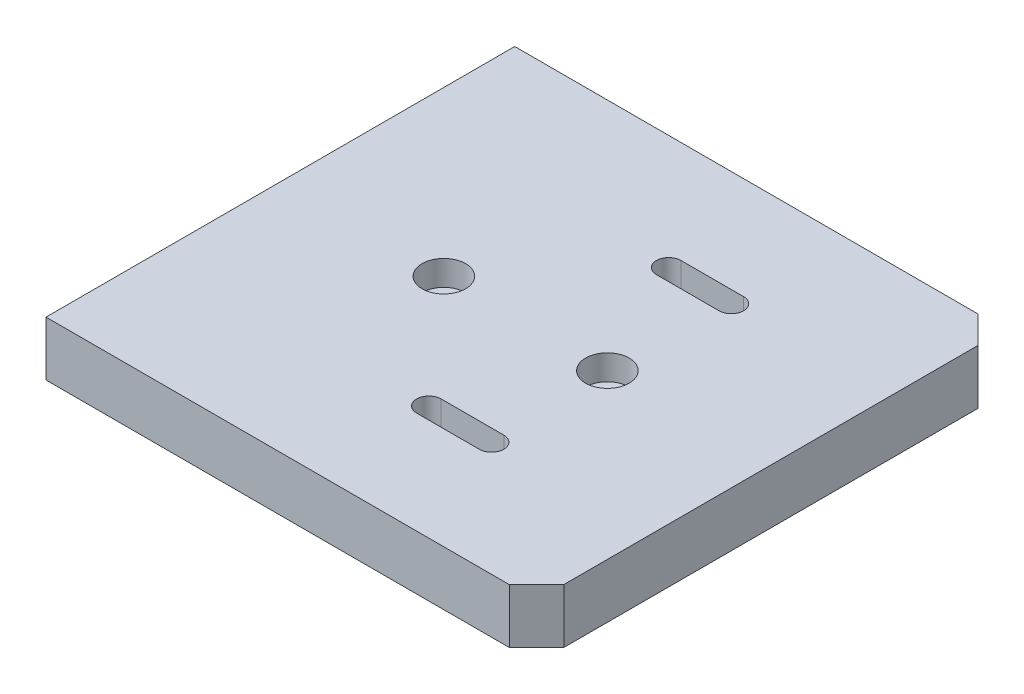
ISO-10303-21;
HEADER;
FILE_DESCRIPTION(('STEP AP214'),'2;1');
FILE_NAME('part.step','',(''),(''),'','','');
FILE_SCHEMA(('AUTOMOTIVE_DESIGN { 1 0 10303 214 1 1 1 1 }'));
ENDSEC;
DATA;
#1=APPLICATION_CONTEXT('core data for automotive mechanical design processes');
#2=APPLICATION_PROTOCOL_DEFINITION('international standard','automotive_design',2000,#1);
#3=PRODUCT_CONTEXT('',#1,'mechanical');
#4=PRODUCT('Part','Part','',(#3));
#5=PRODUCT_RELATED_PRODUCT_CATEGORY('part','',(#4));
#6=PRODUCT_DEFINITION_FORMATION('','',#4);
#7=PRODUCT_DEFINITION_CONTEXT('part definition',#1,'design');
#8=PRODUCT_DEFINITION('design','',#6,#7);
#9=PRODUCT_DEFINITION_SHAPE('','',#8);
#10=(LENGTH_UNIT() NAMED_UNIT(*) SI_UNIT(.MILLI.,.METRE.));
#11=(NAMED_UNIT(*) PLANE_ANGLE_UNIT() SI_UNIT($,.RADIAN.));
#12=(NAMED_UNIT(*) SI_UNIT($,.STERADIAN.) SOLID_ANGLE_UNIT());
#13=UNCERTAINTY_MEASURE_WITH_UNIT(LENGTH_MEASURE(1.E-05),#10,'distance_accuracy_value','');
#14=(GEOMETRIC_REPRESENTATION_CONTEXT(3) GLOBAL_UNCERTAINTY_ASSIGNED_CONTEXT((#13)) GLOBAL_UNIT_ASSIGNED_CONTEXT((#10,
#11,#12)) REPRESENTATION_CONTEXT('',''));
#15=CARTESIAN_POINT('',(0.,0.,0.));
#16=DIRECTION('',(0.,0.,1.));
#17=DIRECTION('',(1.,0.,0.));
#18=AXIS2_PLACEMENT_3D('',#15,#16,#17);
#19=CARTESIAN_POINT('',(0.,31.6094189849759,-86.));
#20=DIRECTION('',(0.,-1.,0.));
#21=DIRECTION('',(0.,0.,-1.));
#22=AXIS2_PLACEMENT_3D('',#19,#20,#21);
#23=PLANE('',#22);
#24=CARTESIAN_POINT('',(60.,31.6094189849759,-43.));
#25=DIRECTION('',(0.,1.,0.));
#26=DIRECTION('',(0.,0.,1.));
#27=AXIS2_PLACEMENT_3D('',#24,#25,#26);
#28=CIRCLE('',#27,2.25);
#29=CARTESIAN_POINT('',(60.,31.6094189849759,-40.75));
#30=VERTEX_POINT('',#29);
#31=EDGE_CURVE('E545',#30,#30,#28,.T.);
#32=ORIENTED_EDGE('',*,*,#31,.T.);
#33=EDGE_LOOP('',(#32));
#34=FACE_BOUND('',#33,.T.);
#35=CARTESIAN_POINT('',(30.,31.6094189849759,-43.));
#36=DIRECTION('',(0.,1.,0.));
#37=DIRECTION('',(0.,0.,1.));
#38=AXIS2_PLACEMENT_3D('',#35,#36,#37);
#39=CIRCLE('',#38,2.25);
#40=CARTESIAN_POINT('',(30.,31.6094189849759,-40.75));
#41=VERTEX_POINT('',#40);
#42=EDGE_CURVE('E193',#41,#41,#39,.T.);
#43=ORIENTED_EDGE('',*,*,#42,.T.);
#44=EDGE_LOOP('',(#43));
#45=FACE_BOUND('',#44,.T.);
#46=CARTESIAN_POINT('',(49.25,31.6094189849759,-21.));
#47=DIRECTION('',(0.,-1.,0.));
#48=DIRECTION('',(0.,0.,-1.));
#49=AXIS2_PLACEMENT_3D('',#46,#47,#48);
#50=CIRCLE('',#49,4.);
#51=CARTESIAN_POINT('',(49.25,31.6094189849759,-17.));
#52=VERTEX_POINT('',#51);
#53=CARTESIAN_POINT('',(49.25,31.6094189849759,-25.));
#54=VERTEX_POINT('',#53);
#55=EDGE_CURVE('E230',#52,#54,#50,.T.);
#56=ORIENTED_EDGE('',*,*,#55,.F.);
#57=DIRECTION('',(1.,0.,0.));
#58=VECTOR('',#57,1.);
#59=CARTESIAN_POINT('',(49.25,31.6094189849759,-17.));
#60=LINE('',#59,#58);
#61=CARTESIAN_POINT('',(60.75,31.6094189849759,-17.));
#62=VERTEX_POINT('',#61);
#63=EDGE_CURVE('E222',#52,#62,#60,.T.);
#64=ORIENTED_EDGE('',*,*,#63,.T.);
#65=CARTESIAN_POINT('',(60.75,31.6094189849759,-21.));
#66=DIRECTION('',(0.,-1.,0.));
#67=DIRECTION('',(0.,0.,-1.));
#68=AXIS2_PLACEMENT_3D('',#65,#66,#67);
#69=CIRCLE('',#68,4.);
#70=CARTESIAN_POINT('',(60.75,31.6094189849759,-25.));
#71=VERTEX_POINT('',#70);
#72=EDGE_CURVE('E252',#71,#62,#69,.T.);
#73=ORIENTED_EDGE('',*,*,#72,.F.);
#74=DIRECTION('',(1.,0.,0.));
#75=VECTOR('',#74,1.);
#76=CARTESIAN_POINT('',(49.25,31.6094189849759,-25.));
#77=LINE('',#76,#75);
#78=EDGE_CURVE('E205',#54,#71,#77,.T.);
#79=ORIENTED_EDGE('',*,*,#78,.F.);
#80=EDGE_LOOP('',(#56,#64,#73,#79));
#81=FACE_BOUND('',#80,.T.);
#82=DIRECTION('',(1.,0.,0.));
#83=VECTOR('',#82,1.);
#84=CARTESIAN_POINT('',(0.,31.6094189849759,-86.));
#85=LINE('',#84,#83);
#86=CARTESIAN_POINT('',(0.,31.6094189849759,-86.));
#87=VERTEX_POINT('',#86);
#88=CARTESIAN_POINT('',(85.,31.6094189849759,-86.));
#89=VERTEX_POINT('',#88);
#90=EDGE_CURVE('E337',#87,#89,#85,.T.);
#91=ORIENTED_EDGE('',*,*,#90,.T.);
#92=DIRECTION('',(0.707106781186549,0.,0.707106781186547));
#93=VECTOR('',#92,1.);
#94=CARTESIAN_POINT('',(42.5,31.6094189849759,-128.5));
#95=LINE('',#94,#93);
#96=CARTESIAN_POINT('',(90.,31.6094189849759,-81.));
#97=VERTEX_POINT('',#96);
#98=EDGE_CURVE('E24',#89,#97,#95,.T.);
#99=ORIENTED_EDGE('',*,*,#98,.T.);
#100=DIRECTION('',(0.,0.,1.));
#101=VECTOR('',#100,1.);
#102=CARTESIAN_POINT('',(90.,31.6094189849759,-86.));
#103=LINE('',#102,#101);
#104=CARTESIAN_POINT('',(90.,31.6094189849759,-5.00000000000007));
#105=VERTEX_POINT('',#104);
#106=EDGE_CURVE('E355',#97,#105,#103,.T.);
#107=ORIENTED_EDGE('',*,*,#106,.T.);
#108=DIRECTION('',(0.707106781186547,0.,-0.707106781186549));
#109=VECTOR('',#108,1.);
#110=CARTESIAN_POINT('',(85.5,31.6094189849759,-0.500000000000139));
#111=LINE('',#110,#109);
#112=CARTESIAN_POINT('',(85.,31.6094189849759,0.));
#113=VERTEX_POINT('',#112);
#114=EDGE_CURVE('E31',#105,#113,#111,.F.);
#115=ORIENTED_EDGE('',*,*,#114,.T.);
#116=DIRECTION('',(1.,0.,0.));
#117=VECTOR('',#116,1.);
#118=CARTESIAN_POINT('',(0.,31.6094189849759,0.));
#119=LINE('',#118,#117);
#120=CARTESIAN_POINT('',(0.,31.6094189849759,0.));
#121=VERTEX_POINT('',#120);
#122=EDGE_CURVE('E345',#121,#113,#119,.T.);
#123=ORIENTED_EDGE('',*,*,#122,.F.);
#124=DIRECTION('',(0.,0.,1.));
#125=VECTOR('',#124,1.);
#126=CARTESIAN_POINT('',(0.,31.6094189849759,-86.));
#127=LINE('',#126,#125);
#128=EDGE_CURVE('E342',#87,#121,#127,.T.);
#129=ORIENTED_EDGE('',*,*,#128,.F.);
#130=EDGE_LOOP('',(#91,#99,#107,#115,#123,#129));
#131=FACE_BOUND('',#130,.T.);
#132=CARTESIAN_POINT('',(49.25,31.6094189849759,-65.));
#133=DIRECTION('',(0.,-1.,0.));
#134=DIRECTION('',(0.,0.,-1.));
#135=AXIS2_PLACEMENT_3D('',#132,#133,#134);
#136=CIRCLE('',#135,4.);
#137=CARTESIAN_POINT('',(49.25,31.6094189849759,-61.));
#138=VERTEX_POINT('',#137);
#139=CARTESIAN_POINT('',(49.25,31.6094189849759,-69.));
#140=VERTEX_POINT('',#139);
#141=EDGE_CURVE('E294',#138,#140,#136,.T.);
#142=ORIENTED_EDGE('',*,*,#141,.F.);
#143=DIRECTION('',(1.,0.,0.));
#144=VECTOR('',#143,1.);
#145=CARTESIAN_POINT('',(49.25,31.6094189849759,-61.));
#146=LINE('',#145,#144);
#147=CARTESIAN_POINT('',(60.75,31.6094189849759,-61.));
#148=VERTEX_POINT('',#147);
#149=EDGE_CURVE('E286',#138,#148,#146,.T.);
#150=ORIENTED_EDGE('',*,*,#149,.T.);
#151=CARTESIAN_POINT('',(60.75,31.6094189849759,-65.));
#152=DIRECTION('',(0.,-1.,0.));
#153=DIRECTION('',(0.,0.,-1.));
#154=AXIS2_PLACEMENT_3D('',#151,#152,#153);
#155=CIRCLE('',#154,4.);
#156=CARTESIAN_POINT('',(60.75,31.6094189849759,-69.));
#157=VERTEX_POINT('',#156);
#158=EDGE_CURVE('E316',#157,#148,#155,.T.);
#159=ORIENTED_EDGE('',*,*,#158,.F.);
#160=DIRECTION('',(1.,0.,0.));
#161=VECTOR('',#160,1.);
#162=CARTESIAN_POINT('',(49.25,31.6094189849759,-69.));
#163=LINE('',#162,#161);
#164=EDGE_CURVE('E269',#140,#157,#163,.T.);
#165=ORIENTED_EDGE('',*,*,#164,.F.);
#166=EDGE_LOOP('',(#142,#150,#159,#165));
#167=FACE_BOUND('',#166,.T.);
#168=ADVANCED_FACE('F16',(#34,#45,#81,#131,#167),#23,.T.);
#169=CARTESIAN_POINT('',(0.,41.6094189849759,-86.));
#170=DIRECTION('',(-1.,0.,0.));
#171=DIRECTION('',(0.,-1.,0.));
#172=AXIS2_PLACEMENT_3D('',#169,#170,#171);
#173=PLANE('',#172);
#174=CARTESIAN_POINT('',(0.,36.6094189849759,-71.));
#175=DIRECTION('',(-1.,0.,0.));
#176=DIRECTION('',(0.,0.,1.));
#177=AXIS2_PLACEMENT_3D('',#174,#175,#176);
#178=CIRCLE('',#177,1.65);
#179=CARTESIAN_POINT('',(0.,36.6094189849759,-69.35));
#180=VERTEX_POINT('',#179);
#181=EDGE_CURVE('E187',#180,#180,#178,.T.);
#182=ORIENTED_EDGE('',*,*,#181,.F.);
#183=EDGE_LOOP('',(#182));
#184=FACE_BOUND('',#183,.T.);
#185=CARTESIAN_POINT('',(0.,36.6094189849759,-43.));
#186=DIRECTION('',(-1.,0.,0.));
#187=DIRECTION('',(0.,0.,1.));
#188=AXIS2_PLACEMENT_3D('',#185,#186,#187);
#189=CIRCLE('',#188,1.65);
#190=CARTESIAN_POINT('',(0.,36.6094189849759,-41.35));
#191=VERTEX_POINT('',#190);
#192=EDGE_CURVE('E186',#191,#191,#189,.T.);
#193=ORIENTED_EDGE('',*,*,#192,.F.);
#194=EDGE_LOOP('',(#193));
#195=FACE_BOUND('',#194,.T.);
#196=CARTESIAN_POINT('',(0.,36.6094189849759,-15.));
#197=DIRECTION('',(-1.,0.,0.));
#198=DIRECTION('',(0.,0.,1.));
#199=AXIS2_PLACEMENT_3D('',#196,#197,#198);
#200=CIRCLE('',#199,1.65);
#201=CARTESIAN_POINT('',(0.,36.6094189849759,-13.35));
#202=VERTEX_POINT('',#201);
#203=EDGE_CURVE('E199',#202,#202,#200,.T.);
#204=ORIENTED_EDGE('',*,*,#203,.F.);
#205=EDGE_LOOP('',(#204));
#206=FACE_BOUND('',#205,.T.);
#207=DIRECTION('',(0.,-1.,0.));
#208=VECTOR('',#207,1.);
#209=CARTESIAN_POINT('',(0.,41.6094189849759,0.));
#210=LINE('',#209,#208);
#211=CARTESIAN_POINT('',(0.,41.6094189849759,0.));
#212=VERTEX_POINT('',#211);
#213=EDGE_CURVE('E333',#212,#121,#210,.T.);
#214=ORIENTED_EDGE('',*,*,#213,.F.);
#215=DIRECTION('',(0.,0.,1.));
#216=VECTOR('',#215,1.);
#217=CARTESIAN_POINT('',(0.,41.6094189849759,-86.));
#218=LINE('',#217,#216);
#219=CARTESIAN_POINT('',(0.,41.6094189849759,-86.));
#220=VERTEX_POINT('',#219);
#221=EDGE_CURVE('E348',#220,#212,#218,.T.);
#222=ORIENTED_EDGE('',*,*,#221,.F.);
#223=DIRECTION('',(0.,-1.,0.));
#224=VECTOR('',#223,1.);
#225=CARTESIAN_POINT('',(0.,41.6094189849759,-86.));
#226=LINE('',#225,#224);
#227=EDGE_CURVE('E334',#220,#87,#226,.T.);
#228=ORIENTED_EDGE('',*,*,#227,.T.);
#229=ORIENTED_EDGE('',*,*,#128,.T.);
#230=EDGE_LOOP('',(#214,#222,#228,#229));
#231=FACE_BOUND('',#230,.T.);
#232=ADVANCED_FACE('F384',(#184,#195,#206,#231),#173,.T.);
#233=CARTESIAN_POINT('',(0.,41.6094189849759,-86.));
#234=DIRECTION('',(0.,1.,0.));
#235=DIRECTION('',(0.,0.,1.));
#236=AXIS2_PLACEMENT_3D('',#233,#234,#235);
#237=PLANE('',#236);
#238=CARTESIAN_POINT('',(60.,41.6094189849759,-43.));
#239=DIRECTION('',(0.,1.,0.));
#240=DIRECTION('',(0.,0.,1.));
#241=AXIS2_PLACEMENT_3D('',#238,#239,#240);
#242=CIRCLE('',#241,4.);
#243=CARTESIAN_POINT('',(60.,41.6094189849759,-39.));
#244=VERTEX_POINT('',#243);
#245=EDGE_CURVE('E538',#244,#244,#242,.T.);
#246=ORIENTED_EDGE('',*,*,#245,.F.);
#247=EDGE_LOOP('',(#246));
#248=FACE_BOUND('',#247,.T.);
#249=CARTESIAN_POINT('',(30.,41.6094189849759,-43.));
#250=DIRECTION('',(0.,1.,0.));
#251=DIRECTION('',(0.,0.,1.));
#252=AXIS2_PLACEMENT_3D('',#249,#250,#251);
#253=CIRCLE('',#252,4.);
#254=CARTESIAN_POINT('',(30.,41.6094189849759,-39.));
#255=VERTEX_POINT('',#254);
#256=EDGE_CURVE('E547',#255,#255,#253,.T.);
#257=ORIENTED_EDGE('',*,*,#256,.F.);
#258=EDGE_LOOP('',(#257));
#259=FACE_BOUND('',#258,.T.);
#260=DIRECTION('',(1.,0.,0.));
#261=VECTOR('',#260,1.);
#262=CARTESIAN_POINT('',(49.25,41.6094189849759,-18.75));
#263=LINE('',#262,#261);
#264=CARTESIAN_POINT('',(49.25,41.6094189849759,-18.75));
#265=VERTEX_POINT('',#264);
#266=CARTESIAN_POINT('',(60.75,41.6094189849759,-18.75));
#267=VERTEX_POINT('',#266);
#268=EDGE_CURVE('E216',#265,#267,#263,.T.);
#269=ORIENTED_EDGE('',*,*,#268,.F.);
#270=CARTESIAN_POINT('',(49.25,41.6094189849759,-21.));
#271=DIRECTION('',(0.,-1.,0.));
#272=DIRECTION('',(0.,0.,-1.));
#273=AXIS2_PLACEMENT_3D('',#270,#271,#272);
#274=CIRCLE('',#273,2.25);
#275=CARTESIAN_POINT('',(49.25,41.6094189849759,-23.25));
#276=VERTEX_POINT('',#275);
#277=EDGE_CURVE('E238',#265,#276,#274,.T.);
#278=ORIENTED_EDGE('',*,*,#277,.T.);
#279=DIRECTION('',(1.,0.,0.));
#280=VECTOR('',#279,1.);
#281=CARTESIAN_POINT('',(49.25,41.6094189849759,-23.25));
#282=LINE('',#281,#280);
#283=CARTESIAN_POINT('',(60.75,41.6094189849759,-23.25));
#284=VERTEX_POINT('',#283);
#285=EDGE_CURVE('E213',#276,#284,#282,.T.);
#286=ORIENTED_EDGE('',*,*,#285,.T.);
#287=CARTESIAN_POINT('',(60.75,41.6094189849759,-21.));
#288=DIRECTION('',(0.,-1.,0.));
#289=DIRECTION('',(0.,0.,-1.));
#290=AXIS2_PLACEMENT_3D('',#287,#288,#289);
#291=CIRCLE('',#290,2.25);
#292=EDGE_CURVE('E261',#284,#267,#291,.T.);
#293=ORIENTED_EDGE('',*,*,#292,.T.);
#294=EDGE_LOOP('',(#269,#278,#286,#293));
#295=FACE_BOUND('',#294,.T.);
#296=DIRECTION('',(1.,0.,0.));
#297=VECTOR('',#296,1.);
#298=CARTESIAN_POINT('',(49.25,41.6094189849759,-62.75));
#299=LINE('',#298,#297);
#300=CARTESIAN_POINT('',(49.25,41.6094189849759,-62.75));
#301=VERTEX_POINT('',#300);
#302=CARTESIAN_POINT('',(60.75,41.6094189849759,-62.75));
#303=VERTEX_POINT('',#302);
#304=EDGE_CURVE('E280',#301,#303,#299,.T.);
#305=ORIENTED_EDGE('',*,*,#304,.F.);
#306=CARTESIAN_POINT('',(49.25,41.6094189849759,-65.));
#307=DIRECTION('',(0.,-1.,0.));
#308=DIRECTION('',(0.,0.,-1.));
#309=AXIS2_PLACEMENT_3D('',#306,#307,#308);
#310=CIRCLE('',#309,2.25);
#311=CARTESIAN_POINT('',(49.25,41.6094189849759,-67.25));
#312=VERTEX_POINT('',#311);
#313=EDGE_CURVE('E302',#301,#312,#310,.T.);
#314=ORIENTED_EDGE('',*,*,#313,.T.);
#315=DIRECTION('',(1.,0.,0.));
#316=VECTOR('',#315,1.);
#317=CARTESIAN_POINT('',(49.25,41.6094189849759,-67.25));
#318=LINE('',#317,#316);
#319=CARTESIAN_POINT('',(60.75,41.6094189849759,-67.25));
#320=VERTEX_POINT('',#319);
#321=EDGE_CURVE('E277',#312,#320,#318,.T.);
#322=ORIENTED_EDGE('',*,*,#321,.T.);
#323=CARTESIAN_POINT('',(60.75,41.6094189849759,-65.));
#324=DIRECTION('',(0.,-1.,0.));
#325=DIRECTION('',(0.,0.,-1.));
#326=AXIS2_PLACEMENT_3D('',#323,#324,#325);
#327=CIRCLE('',#326,2.25);
#328=EDGE_CURVE('E325',#320,#303,#327,.T.);
#329=ORIENTED_EDGE('',*,*,#328,.T.);
#330=EDGE_LOOP('',(#305,#314,#322,#329));
#331=FACE_BOUND('',#330,.T.);
#332=DIRECTION('',(0.,0.,1.));
#333=VECTOR('',#332,1.);
#334=CARTESIAN_POINT('',(90.,41.6094189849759,-86.));
#335=LINE('',#334,#333);
#336=CARTESIAN_POINT('',(90.,41.6094189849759,-81.));
#337=VERTEX_POINT('',#336);
#338=CARTESIAN_POINT('',(90.,41.6094189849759,-5.));
#339=VERTEX_POINT('',#338);
#340=EDGE_CURVE('E352',#337,#339,#335,.T.);
#341=ORIENTED_EDGE('',*,*,#340,.F.);
#342=DIRECTION('',(-0.707106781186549,0.,-0.707106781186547));
#343=VECTOR('',#342,1.);
#344=CARTESIAN_POINT('',(42.5,41.6094189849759,-128.5));
#345=LINE('',#344,#343);
#346=CARTESIAN_POINT('',(85.,41.6094189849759,-86.));
#347=VERTEX_POINT('',#346);
#348=EDGE_CURVE('E364',#337,#347,#345,.T.);
#349=ORIENTED_EDGE('',*,*,#348,.T.);
#350=DIRECTION('',(-1.,0.,0.));
#351=VECTOR('',#350,1.);
#352=CARTESIAN_POINT('',(0.,41.6094189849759,-86.));
#353=LINE('',#352,#351);
#354=EDGE_CURVE('E340',#347,#220,#353,.T.);
#355=ORIENTED_EDGE('',*,*,#354,.T.);
#356=ORIENTED_EDGE('',*,*,#221,.T.);
#357=DIRECTION('',(-1.,0.,0.));
#358=VECTOR('',#357,1.);
#359=CARTESIAN_POINT('',(0.,41.6094189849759,0.));
#360=LINE('',#359,#358);
#361=CARTESIAN_POINT('',(85.,41.6094189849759,0.));
#362=VERTEX_POINT('',#361);
#363=EDGE_CURVE('E338',#362,#212,#360,.T.);
#364=ORIENTED_EDGE('',*,*,#363,.F.);
#365=DIRECTION('',(-0.707106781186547,0.,0.707106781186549));
#366=VECTOR('',#365,1.);
#367=CARTESIAN_POINT('',(85.5,41.6094189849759,-0.500000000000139));
#368=LINE('',#367,#366);
#369=EDGE_CURVE('E362',#362,#339,#368,.F.);
#370=ORIENTED_EDGE('',*,*,#369,.T.);
#371=EDGE_LOOP('',(#341,#349,#355,#356,#364,#370));
#372=FACE_BOUND('',#371,.T.);
#373=ADVANCED_FACE('F378',(#248,#259,#295,#331,#372),#237,.T.);
#374=CARTESIAN_POINT('',(90.,41.6094189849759,-86.));
#375=DIRECTION('',(1.,0.,0.));
#376=DIRECTION('',(0.,0.,-1.));
#377=AXIS2_PLACEMENT_3D('',#374,#375,#376);
#378=PLANE('',#377);
#379=ORIENTED_EDGE('',*,*,#106,.F.);
#380=DIRECTION('',(0.,1.,0.));
#381=VECTOR('',#380,1.);
#382=CARTESIAN_POINT('',(90.,41.6094189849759,-81.));
#383=LINE('',#382,#381);
#384=EDGE_CURVE('E359',#97,#337,#383,.T.);
#385=ORIENTED_EDGE('',*,*,#384,.T.);
#386=ORIENTED_EDGE('',*,*,#340,.T.);
#387=DIRECTION('',(0.,-1.,0.));
#388=VECTOR('',#387,1.);
#389=CARTESIAN_POINT('',(90.,41.6094189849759,-5.));
#390=LINE('',#389,#388);
#391=EDGE_CURVE('E351',#339,#105,#390,.T.);
#392=ORIENTED_EDGE('',*,*,#391,.T.);
#393=EDGE_LOOP('',(#379,#385,#386,#392));
#394=FACE_BOUND('',#393,.T.);
#395=ADVANCED_FACE('F373',(#394),#378,.T.);
#396=CARTESIAN_POINT('',(0.,0.,-86.));
#397=DIRECTION('',(0.,0.,1.));
#398=DIRECTION('',(1.,0.,0.));
#399=AXIS2_PLACEMENT_3D('',#396,#397,#398);
#400=PLANE('',#399);
#401=ORIENTED_EDGE('',*,*,#354,.F.);
#402=DIRECTION('',(0.,-1.,0.));
#403=VECTOR('',#402,1.);
#404=CARTESIAN_POINT('',(85.,31.6094189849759,-86.));
#405=LINE('',#404,#403);
#406=EDGE_CURVE('E39',#347,#89,#405,.T.);
#407=ORIENTED_EDGE('',*,*,#406,.T.);
#408=ORIENTED_EDGE('',*,*,#90,.F.);
#409=ORIENTED_EDGE('',*,*,#227,.F.);
#410=EDGE_LOOP('',(#401,#407,#408,#409));
#411=FACE_BOUND('',#410,.T.);
#412=ADVANCED_FACE('F381',(#411),#400,.F.);
#413=CARTESIAN_POINT('',(0.,0.,0.));
#414=DIRECTION('',(0.,0.,1.));
#415=DIRECTION('',(1.,0.,0.));
#416=AXIS2_PLACEMENT_3D('',#413,#414,#415);
#417=PLANE('',#416);
#418=ORIENTED_EDGE('',*,*,#122,.T.);
#419=DIRECTION('',(0.,1.,0.));
#420=VECTOR('',#419,1.);
#421=CARTESIAN_POINT('',(85.,0.,0.));
#422=LINE('',#421,#420);
#423=EDGE_CURVE('E11',#113,#362,#422,.T.);
#424=ORIENTED_EDGE('',*,*,#423,.T.);
#425=ORIENTED_EDGE('',*,*,#363,.T.);
#426=ORIENTED_EDGE('',*,*,#213,.T.);
#427=EDGE_LOOP('',(#418,#424,#425,#426));
#428=FACE_BOUND('',#427,.T.);
#429=ADVANCED_FACE('F387',(#428),#417,.T.);
#430=CARTESIAN_POINT('',(60.75,31.6094189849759,-65.));
#431=DIRECTION('',(0.,-1.,0.));
#432=DIRECTION('',(0.,0.,-1.));
#433=AXIS2_PLACEMENT_3D('',#430,#431,#432);
#434=CYLINDRICAL_SURFACE('',#433,2.25);
#435=ORIENTED_EDGE('',*,*,#328,.F.);
#436=DIRECTION('',(0.,-1.,0.));
#437=VECTOR('',#436,1.);
#438=CARTESIAN_POINT('',(60.75,31.6094189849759,-67.25));
#439=LINE('',#438,#437);
#440=CARTESIAN_POINT('',(60.75,36.2094189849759,-67.25));
#441=VERTEX_POINT('',#440);
#442=EDGE_CURVE('E314',#441,#320,#439,.F.);
#443=ORIENTED_EDGE('',*,*,#442,.F.);
#444=CARTESIAN_POINT('',(60.75,36.2094189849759,-65.));
#445=DIRECTION('',(0.,-1.,0.));
#446=DIRECTION('',(0.,0.,-1.));
#447=AXIS2_PLACEMENT_3D('',#444,#445,#446);
#448=CIRCLE('',#447,2.25);
#449=CARTESIAN_POINT('',(60.75,36.2094189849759,-62.75));
#450=VERTEX_POINT('',#449);
#451=EDGE_CURVE('E322',#441,#450,#448,.T.);
#452=ORIENTED_EDGE('',*,*,#451,.T.);
#453=DIRECTION('',(0.,-1.,0.));
#454=VECTOR('',#453,1.);
#455=CARTESIAN_POINT('',(60.75,31.6094189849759,-62.75));
#456=LINE('',#455,#454);
#457=EDGE_CURVE('E311',#303,#450,#456,.T.);
#458=ORIENTED_EDGE('',*,*,#457,.F.);
#459=EDGE_LOOP('',(#435,#443,#452,#458));
#460=FACE_BOUND('',#459,.T.);
#461=ADVANCED_FACE('F421',(#460),#434,.F.);
#462=CARTESIAN_POINT('',(63.,36.2094189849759,-65.));
#463=DIRECTION('',(0.,1.,0.));
#464=DIRECTION('',(0.,0.,1.));
#465=AXIS2_PLACEMENT_3D('',#462,#463,#464);
#466=PLANE('',#465);
#467=DIRECTION('',(1.,0.,0.));
#468=VECTOR('',#467,1.);
#469=CARTESIAN_POINT('',(49.25,36.2094189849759,-67.25));
#470=LINE('',#469,#468);
#471=CARTESIAN_POINT('',(49.25,36.2094189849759,-67.25));
#472=VERTEX_POINT('',#471);
#473=EDGE_CURVE('E274',#472,#441,#470,.T.);
#474=ORIENTED_EDGE('',*,*,#473,.F.);
#475=CARTESIAN_POINT('',(49.25,36.2094189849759,-65.));
#476=DIRECTION('',(0.,-1.,0.));
#477=DIRECTION('',(0.,0.,-1.));
#478=AXIS2_PLACEMENT_3D('',#475,#476,#477);
#479=CIRCLE('',#478,2.25);
#480=CARTESIAN_POINT('',(49.25,36.2094189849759,-62.75));
#481=VERTEX_POINT('',#480);
#482=EDGE_CURVE('E299',#481,#472,#479,.T.);
#483=ORIENTED_EDGE('',*,*,#482,.F.);
#484=DIRECTION('',(1.,0.,0.));
#485=VECTOR('',#484,1.);
#486=CARTESIAN_POINT('',(49.25,36.2094189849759,-62.75));
#487=LINE('',#486,#485);
#488=EDGE_CURVE('E282',#481,#450,#487,.T.);
#489=ORIENTED_EDGE('',*,*,#488,.T.);
#490=ORIENTED_EDGE('',*,*,#451,.F.);
#491=EDGE_LOOP('',(#474,#483,#489,#490));
#492=FACE_BOUND('',#491,.T.);
#493=CARTESIAN_POINT('',(60.75,36.2094189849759,-65.));
#494=DIRECTION('',(0.,-1.,0.));
#495=DIRECTION('',(0.,0.,-1.));
#496=AXIS2_PLACEMENT_3D('',#493,#494,#495);
#497=CIRCLE('',#496,4.);
#498=CARTESIAN_POINT('',(60.75,36.2094189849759,-69.));
#499=VERTEX_POINT('',#498);
#500=CARTESIAN_POINT('',(60.75,36.2094189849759,-61.));
#501=VERTEX_POINT('',#500);
#502=EDGE_CURVE('E319',#499,#501,#497,.T.);
#503=ORIENTED_EDGE('',*,*,#502,.T.);
#504=DIRECTION('',(1.,0.,0.));
#505=VECTOR('',#504,1.);
#506=CARTESIAN_POINT('',(49.25,36.2094189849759,-61.));
#507=LINE('',#506,#505);
#508=CARTESIAN_POINT('',(49.25,36.2094189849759,-61.));
#509=VERTEX_POINT('',#508);
#510=EDGE_CURVE('E284',#509,#501,#507,.T.);
#511=ORIENTED_EDGE('',*,*,#510,.F.);
#512=CARTESIAN_POINT('',(49.25,36.2094189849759,-65.));
#513=DIRECTION('',(0.,-1.,0.));
#514=DIRECTION('',(0.,0.,-1.));
#515=AXIS2_PLACEMENT_3D('',#512,#513,#514);
#516=CIRCLE('',#515,4.);
#517=CARTESIAN_POINT('',(49.25,36.2094189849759,-69.));
#518=VERTEX_POINT('',#517);
#519=EDGE_CURVE('E296',#509,#518,#516,.T.);
#520=ORIENTED_EDGE('',*,*,#519,.T.);
#521=DIRECTION('',(1.,0.,0.));
#522=VECTOR('',#521,1.);
#523=CARTESIAN_POINT('',(49.25,36.2094189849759,-69.));
#524=LINE('',#523,#522);
#525=EDGE_CURVE('E271',#518,#499,#524,.T.);
#526=ORIENTED_EDGE('',*,*,#525,.T.);
#527=EDGE_LOOP('',(#503,#511,#520,#526));
#528=FACE_BOUND('',#527,.T.);
#529=ADVANCED_FACE('F426',(#492,#528),#466,.F.);
#530=CARTESIAN_POINT('',(60.75,31.6094189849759,-65.));
#531=DIRECTION('',(0.,-1.,0.));
#532=DIRECTION('',(0.,0.,-1.));
#533=AXIS2_PLACEMENT_3D('',#530,#531,#532);
#534=CYLINDRICAL_SURFACE('',#533,4.);
#535=ORIENTED_EDGE('',*,*,#502,.F.);
#536=DIRECTION('',(0.,-1.,0.));
#537=VECTOR('',#536,1.);
#538=CARTESIAN_POINT('',(60.75,31.6094189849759,-69.));
#539=LINE('',#538,#537);
#540=EDGE_CURVE('E330',#157,#499,#539,.F.);
#541=ORIENTED_EDGE('',*,*,#540,.F.);
#542=ORIENTED_EDGE('',*,*,#158,.T.);
#543=DIRECTION('',(0.,-1.,0.));
#544=VECTOR('',#543,1.);
#545=CARTESIAN_POINT('',(60.75,31.6094189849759,-61.));
#546=LINE('',#545,#544);
#547=EDGE_CURVE('E328',#501,#148,#546,.T.);
#548=ORIENTED_EDGE('',*,*,#547,.F.);
#549=EDGE_LOOP('',(#535,#541,#542,#548));
#550=FACE_BOUND('',#549,.T.);
#551=ADVANCED_FACE('F430',(#550),#534,.F.);
#552=CARTESIAN_POINT('',(49.25,31.6094189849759,-65.));
#553=DIRECTION('',(0.,-1.,0.));
#554=DIRECTION('',(0.,0.,-1.));
#555=AXIS2_PLACEMENT_3D('',#552,#553,#554);
#556=CYLINDRICAL_SURFACE('',#555,2.25);
#557=ORIENTED_EDGE('',*,*,#482,.T.);
#558=DIRECTION('',(0.,-1.,0.));
#559=VECTOR('',#558,1.);
#560=CARTESIAN_POINT('',(49.25,31.6094189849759,-67.25));
#561=LINE('',#560,#559);
#562=EDGE_CURVE('E289',#312,#472,#561,.T.);
#563=ORIENTED_EDGE('',*,*,#562,.F.);
#564=ORIENTED_EDGE('',*,*,#313,.F.);
#565=DIRECTION('',(0.,-1.,0.));
#566=VECTOR('',#565,1.);
#567=CARTESIAN_POINT('',(49.25,31.6094189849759,-62.75));
#568=LINE('',#567,#566);
#569=EDGE_CURVE('E292',#481,#301,#568,.F.);
#570=ORIENTED_EDGE('',*,*,#569,.F.);
#571=EDGE_LOOP('',(#557,#563,#564,#570));
#572=FACE_BOUND('',#571,.T.);
#573=ADVANCED_FACE('F434',(#572),#556,.F.);
#574=CARTESIAN_POINT('',(49.25,31.6094189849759,-65.));
#575=DIRECTION('',(0.,-1.,0.));
#576=DIRECTION('',(0.,0.,-1.));
#577=AXIS2_PLACEMENT_3D('',#574,#575,#576);
#578=CYLINDRICAL_SURFACE('',#577,4.);
#579=ORIENTED_EDGE('',*,*,#141,.T.);
#580=DIRECTION('',(0.,-1.,0.));
#581=VECTOR('',#580,1.);
#582=CARTESIAN_POINT('',(49.25,31.6094189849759,-69.));
#583=LINE('',#582,#581);
#584=EDGE_CURVE('E305',#518,#140,#583,.T.);
#585=ORIENTED_EDGE('',*,*,#584,.F.);
#586=ORIENTED_EDGE('',*,*,#519,.F.);
#587=DIRECTION('',(0.,-1.,0.));
#588=VECTOR('',#587,1.);
#589=CARTESIAN_POINT('',(49.25,31.6094189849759,-61.));
#590=LINE('',#589,#588);
#591=EDGE_CURVE('E308',#138,#509,#590,.F.);
#592=ORIENTED_EDGE('',*,*,#591,.F.);
#593=EDGE_LOOP('',(#579,#585,#586,#592));
#594=FACE_BOUND('',#593,.T.);
#595=ADVANCED_FACE('F438',(#594),#578,.F.);
#596=CARTESIAN_POINT('',(49.25,31.6094189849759,-61.));
#597=DIRECTION('',(0.,0.,1.));
#598=DIRECTION('',(1.,0.,0.));
#599=AXIS2_PLACEMENT_3D('',#596,#597,#598);
#600=PLANE('',#599);
#601=ORIENTED_EDGE('',*,*,#547,.T.);
#602=ORIENTED_EDGE('',*,*,#149,.F.);
#603=ORIENTED_EDGE('',*,*,#591,.T.);
#604=ORIENTED_EDGE('',*,*,#510,.T.);
#605=EDGE_LOOP('',(#601,#602,#603,#604));
#606=FACE_BOUND('',#605,.T.);
#607=ADVANCED_FACE('F442',(#606),#600,.F.);
#608=CARTESIAN_POINT('',(49.25,31.6094189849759,-62.75));
#609=DIRECTION('',(0.,0.,1.));
#610=DIRECTION('',(1.,0.,0.));
#611=AXIS2_PLACEMENT_3D('',#608,#609,#610);
#612=PLANE('',#611);
#613=ORIENTED_EDGE('',*,*,#457,.T.);
#614=ORIENTED_EDGE('',*,*,#488,.F.);
#615=ORIENTED_EDGE('',*,*,#569,.T.);
#616=ORIENTED_EDGE('',*,*,#304,.T.);
#617=EDGE_LOOP('',(#613,#614,#615,#616));
#618=FACE_BOUND('',#617,.T.);
#619=ADVANCED_FACE('F446',(#618),#612,.F.);
#620=CARTESIAN_POINT('',(49.25,31.6094189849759,-67.25));
#621=DIRECTION('',(0.,0.,-1.));
#622=DIRECTION('',(-1.,0.,0.));
#623=AXIS2_PLACEMENT_3D('',#620,#621,#622);
#624=PLANE('',#623);
#625=ORIENTED_EDGE('',*,*,#442,.T.);
#626=ORIENTED_EDGE('',*,*,#321,.F.);
#627=ORIENTED_EDGE('',*,*,#562,.T.);
#628=ORIENTED_EDGE('',*,*,#473,.T.);
#629=EDGE_LOOP('',(#625,#626,#627,#628));
#630=FACE_BOUND('',#629,.T.);
#631=ADVANCED_FACE('F450',(#630),#624,.F.);
#632=CARTESIAN_POINT('',(49.25,31.6094189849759,-69.));
#633=DIRECTION('',(0.,0.,-1.));
#634=DIRECTION('',(-1.,0.,0.));
#635=AXIS2_PLACEMENT_3D('',#632,#633,#634);
#636=PLANE('',#635);
#637=ORIENTED_EDGE('',*,*,#540,.T.);
#638=ORIENTED_EDGE('',*,*,#525,.F.);
#639=ORIENTED_EDGE('',*,*,#584,.T.);
#640=ORIENTED_EDGE('',*,*,#164,.T.);
#641=EDGE_LOOP('',(#637,#638,#639,#640));
#642=FACE_BOUND('',#641,.T.);
#643=ADVANCED_FACE('F454',(#642),#636,.F.);
#644=CARTESIAN_POINT('',(60.75,31.6094189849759,-21.));
#645=DIRECTION('',(0.,-1.,0.));
#646=DIRECTION('',(0.,0.,-1.));
#647=AXIS2_PLACEMENT_3D('',#644,#645,#646);
#648=CYLINDRICAL_SURFACE('',#647,2.25);
#649=ORIENTED_EDGE('',*,*,#292,.F.);
#650=DIRECTION('',(0.,-1.,0.));
#651=VECTOR('',#650,1.);
#652=CARTESIAN_POINT('',(60.75,31.6094189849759,-23.25));
#653=LINE('',#652,#651);
#654=CARTESIAN_POINT('',(60.75,36.2094189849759,-23.25));
#655=VERTEX_POINT('',#654);
#656=EDGE_CURVE('E250',#655,#284,#653,.F.);
#657=ORIENTED_EDGE('',*,*,#656,.F.);
#658=CARTESIAN_POINT('',(60.75,36.2094189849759,-21.));
#659=DIRECTION('',(0.,-1.,0.));
#660=DIRECTION('',(0.,0.,-1.));
#661=AXIS2_PLACEMENT_3D('',#658,#659,#660);
#662=CIRCLE('',#661,2.25);
#663=CARTESIAN_POINT('',(60.75,36.2094189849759,-18.75));
#664=VERTEX_POINT('',#663);
#665=EDGE_CURVE('E258',#655,#664,#662,.T.);
#666=ORIENTED_EDGE('',*,*,#665,.T.);
#667=DIRECTION('',(0.,-1.,0.));
#668=VECTOR('',#667,1.);
#669=CARTESIAN_POINT('',(60.75,31.6094189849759,-18.75));
#670=LINE('',#669,#668);
#671=EDGE_CURVE('E247',#267,#664,#670,.T.);
#672=ORIENTED_EDGE('',*,*,#671,.F.);
#673=EDGE_LOOP('',(#649,#657,#666,#672));
#674=FACE_BOUND('',#673,.T.);
#675=ADVANCED_FACE('F458',(#674),#648,.F.);
#676=CARTESIAN_POINT('',(63.,36.2094189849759,-21.));
#677=DIRECTION('',(0.,1.,0.));
#678=DIRECTION('',(0.,0.,1.));
#679=AXIS2_PLACEMENT_3D('',#676,#677,#678);
#680=PLANE('',#679);
#681=DIRECTION('',(1.,0.,0.));
#682=VECTOR('',#681,1.);
#683=CARTESIAN_POINT('',(49.25,36.2094189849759,-23.25));
#684=LINE('',#683,#682);
#685=CARTESIAN_POINT('',(49.25,36.2094189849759,-23.25));
#686=VERTEX_POINT('',#685);
#687=EDGE_CURVE('E210',#686,#655,#684,.T.);
#688=ORIENTED_EDGE('',*,*,#687,.F.);
#689=CARTESIAN_POINT('',(49.25,36.2094189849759,-21.));
#690=DIRECTION('',(0.,-1.,0.));
#691=DIRECTION('',(0.,0.,-1.));
#692=AXIS2_PLACEMENT_3D('',#689,#690,#691);
#693=CIRCLE('',#692,2.25);
#694=CARTESIAN_POINT('',(49.25,36.2094189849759,-18.75));
#695=VERTEX_POINT('',#694);
#696=EDGE_CURVE('E235',#695,#686,#693,.T.);
#697=ORIENTED_EDGE('',*,*,#696,.F.);
#698=DIRECTION('',(1.,0.,0.));
#699=VECTOR('',#698,1.);
#700=CARTESIAN_POINT('',(49.25,36.2094189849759,-18.75));
#701=LINE('',#700,#699);
#702=EDGE_CURVE('E218',#695,#664,#701,.T.);
#703=ORIENTED_EDGE('',*,*,#702,.T.);
#704=ORIENTED_EDGE('',*,*,#665,.F.);
#705=EDGE_LOOP('',(#688,#697,#703,#704));
#706=FACE_BOUND('',#705,.T.);
#707=CARTESIAN_POINT('',(60.75,36.2094189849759,-21.));
#708=DIRECTION('',(0.,-1.,0.));
#709=DIRECTION('',(0.,0.,-1.));
#710=AXIS2_PLACEMENT_3D('',#707,#708,#709);
#711=CIRCLE('',#710,4.);
#712=CARTESIAN_POINT('',(60.75,36.2094189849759,-25.));
#713=VERTEX_POINT('',#712);
#714=CARTESIAN_POINT('',(60.75,36.2094189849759,-17.));
#715=VERTEX_POINT('',#714);
#716=EDGE_CURVE('E255',#713,#715,#711,.T.);
#717=ORIENTED_EDGE('',*,*,#716,.T.);
#718=DIRECTION('',(1.,0.,0.));
#719=VECTOR('',#718,1.);
#720=CARTESIAN_POINT('',(49.25,36.2094189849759,-17.));
#721=LINE('',#720,#719);
#722=CARTESIAN_POINT('',(49.25,36.2094189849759,-17.));
#723=VERTEX_POINT('',#722);
#724=EDGE_CURVE('E220',#723,#715,#721,.T.);
#725=ORIENTED_EDGE('',*,*,#724,.F.);
#726=CARTESIAN_POINT('',(49.25,36.2094189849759,-21.));
#727=DIRECTION('',(0.,-1.,0.));
#728=DIRECTION('',(0.,0.,-1.));
#729=AXIS2_PLACEMENT_3D('',#726,#727,#728);
#730=CIRCLE('',#729,4.);
#731=CARTESIAN_POINT('',(49.25,36.2094189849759,-25.));
#732=VERTEX_POINT('',#731);
#733=EDGE_CURVE('E232',#723,#732,#730,.T.);
#734=ORIENTED_EDGE('',*,*,#733,.T.);
#735=DIRECTION('',(1.,0.,0.));
#736=VECTOR('',#735,1.);
#737=CARTESIAN_POINT('',(49.25,36.2094189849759,-25.));
#738=LINE('',#737,#736);
#739=EDGE_CURVE('E207',#732,#713,#738,.T.);
#740=ORIENTED_EDGE('',*,*,#739,.T.);
#741=EDGE_LOOP('',(#717,#725,#734,#740));
#742=FACE_BOUND('',#741,.T.);
#743=ADVANCED_FACE('F462',(#706,#742),#680,.F.);
#744=CARTESIAN_POINT('',(60.75,31.6094189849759,-21.));
#745=DIRECTION('',(0.,-1.,0.));
#746=DIRECTION('',(0.,0.,-1.));
#747=AXIS2_PLACEMENT_3D('',#744,#745,#746);
#748=CYLINDRICAL_SURFACE('',#747,4.);
#749=ORIENTED_EDGE('',*,*,#716,.F.);
#750=DIRECTION('',(0.,-1.,0.));
#751=VECTOR('',#750,1.);
#752=CARTESIAN_POINT('',(60.75,31.6094189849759,-25.));
#753=LINE('',#752,#751);
#754=EDGE_CURVE('E266',#71,#713,#753,.F.);
#755=ORIENTED_EDGE('',*,*,#754,.F.);
#756=ORIENTED_EDGE('',*,*,#72,.T.);
#757=DIRECTION('',(0.,-1.,0.));
#758=VECTOR('',#757,1.);
#759=CARTESIAN_POINT('',(60.75,31.6094189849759,-17.));
#760=LINE('',#759,#758);
#761=EDGE_CURVE('E264',#715,#62,#760,.T.);
#762=ORIENTED_EDGE('',*,*,#761,.F.);
#763=EDGE_LOOP('',(#749,#755,#756,#762));
#764=FACE_BOUND('',#763,.T.);
#765=ADVANCED_FACE('F466',(#764),#748,.F.);
#766=CARTESIAN_POINT('',(49.25,31.6094189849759,-21.));
#767=DIRECTION('',(0.,-1.,0.));
#768=DIRECTION('',(0.,0.,-1.));
#769=AXIS2_PLACEMENT_3D('',#766,#767,#768);
#770=CYLINDRICAL_SURFACE('',#769,2.25);
#771=ORIENTED_EDGE('',*,*,#696,.T.);
#772=DIRECTION('',(0.,-1.,0.));
#773=VECTOR('',#772,1.);
#774=CARTESIAN_POINT('',(49.25,31.6094189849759,-23.25));
#775=LINE('',#774,#773);
#776=EDGE_CURVE('E225',#276,#686,#775,.T.);
#777=ORIENTED_EDGE('',*,*,#776,.F.);
#778=ORIENTED_EDGE('',*,*,#277,.F.);
#779=DIRECTION('',(0.,-1.,0.));
#780=VECTOR('',#779,1.);
#781=CARTESIAN_POINT('',(49.25,31.6094189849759,-18.75));
#782=LINE('',#781,#780);
#783=EDGE_CURVE('E228',#695,#265,#782,.F.);
#784=ORIENTED_EDGE('',*,*,#783,.F.);
#785=EDGE_LOOP('',(#771,#777,#778,#784));
#786=FACE_BOUND('',#785,.T.);
#787=ADVANCED_FACE('F470',(#786),#770,.F.);
#788=CARTESIAN_POINT('',(49.25,31.6094189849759,-21.));
#789=DIRECTION('',(0.,-1.,0.));
#790=DIRECTION('',(0.,0.,-1.));
#791=AXIS2_PLACEMENT_3D('',#788,#789,#790);
#792=CYLINDRICAL_SURFACE('',#791,4.);
#793=ORIENTED_EDGE('',*,*,#55,.T.);
#794=DIRECTION('',(0.,-1.,0.));
#795=VECTOR('',#794,1.);
#796=CARTESIAN_POINT('',(49.25,31.6094189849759,-25.));
#797=LINE('',#796,#795);
#798=EDGE_CURVE('E241',#732,#54,#797,.T.);
#799=ORIENTED_EDGE('',*,*,#798,.F.);
#800=ORIENTED_EDGE('',*,*,#733,.F.);
#801=DIRECTION('',(0.,-1.,0.));
#802=VECTOR('',#801,1.);
#803=CARTESIAN_POINT('',(49.25,31.6094189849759,-17.));
#804=LINE('',#803,#802);
#805=EDGE_CURVE('E244',#52,#723,#804,.F.);
#806=ORIENTED_EDGE('',*,*,#805,.F.);
#807=EDGE_LOOP('',(#793,#799,#800,#806));
#808=FACE_BOUND('',#807,.T.);
#809=ADVANCED_FACE('F474',(#808),#792,.F.);
#810=CARTESIAN_POINT('',(49.25,31.6094189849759,-17.));
#811=DIRECTION('',(0.,0.,1.));
#812=DIRECTION('',(1.,0.,0.));
#813=AXIS2_PLACEMENT_3D('',#810,#811,#812);
#814=PLANE('',#813);
#815=ORIENTED_EDGE('',*,*,#761,.T.);
#816=ORIENTED_EDGE('',*,*,#63,.F.);
#817=ORIENTED_EDGE('',*,*,#805,.T.);
#818=ORIENTED_EDGE('',*,*,#724,.T.);
#819=EDGE_LOOP('',(#815,#816,#817,#818));
#820=FACE_BOUND('',#819,.T.);
#821=ADVANCED_FACE('F478',(#820),#814,.F.);
#822=CARTESIAN_POINT('',(49.25,31.6094189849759,-18.75));
#823=DIRECTION('',(0.,0.,1.));
#824=DIRECTION('',(1.,0.,0.));
#825=AXIS2_PLACEMENT_3D('',#822,#823,#824);
#826=PLANE('',#825);
#827=ORIENTED_EDGE('',*,*,#671,.T.);
#828=ORIENTED_EDGE('',*,*,#702,.F.);
#829=ORIENTED_EDGE('',*,*,#783,.T.);
#830=ORIENTED_EDGE('',*,*,#268,.T.);
#831=EDGE_LOOP('',(#827,#828,#829,#830));
#832=FACE_BOUND('',#831,.T.);
#833=ADVANCED_FACE('F482',(#832),#826,.F.);
#834=CARTESIAN_POINT('',(49.25,31.6094189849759,-23.25));
#835=DIRECTION('',(0.,0.,-1.));
#836=DIRECTION('',(-1.,0.,0.));
#837=AXIS2_PLACEMENT_3D('',#834,#835,#836);
#838=PLANE('',#837);
#839=ORIENTED_EDGE('',*,*,#656,.T.);
#840=ORIENTED_EDGE('',*,*,#285,.F.);
#841=ORIENTED_EDGE('',*,*,#776,.T.);
#842=ORIENTED_EDGE('',*,*,#687,.T.);
#843=EDGE_LOOP('',(#839,#840,#841,#842));
#844=FACE_BOUND('',#843,.T.);
#845=ADVANCED_FACE('F486',(#844),#838,.F.);
#846=CARTESIAN_POINT('',(49.25,31.6094189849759,-25.));
#847=DIRECTION('',(0.,0.,-1.));
#848=DIRECTION('',(-1.,0.,0.));
#849=AXIS2_PLACEMENT_3D('',#846,#847,#848);
#850=PLANE('',#849);
#851=ORIENTED_EDGE('',*,*,#754,.T.);
#852=ORIENTED_EDGE('',*,*,#739,.F.);
#853=ORIENTED_EDGE('',*,*,#798,.T.);
#854=ORIENTED_EDGE('',*,*,#78,.T.);
#855=EDGE_LOOP('',(#851,#852,#853,#854));
#856=FACE_BOUND('',#855,.T.);
#857=ADVANCED_FACE('F401',(#856),#850,.F.);
#858=CARTESIAN_POINT('',(90.,41.6094189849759,-81.));
#859=DIRECTION('',(0.707106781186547,0.,-0.707106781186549));
#860=DIRECTION('',(0.,-1.,0.));
#861=AXIS2_PLACEMENT_3D('',#858,#859,#860);
#862=PLANE('',#861);
#863=ORIENTED_EDGE('',*,*,#98,.F.);
#864=ORIENTED_EDGE('',*,*,#406,.F.);
#865=ORIENTED_EDGE('',*,*,#348,.F.);
#866=ORIENTED_EDGE('',*,*,#384,.F.);
#867=EDGE_LOOP('',(#863,#864,#865,#866));
#868=FACE_BOUND('',#867,.T.);
#869=ADVANCED_FACE('F376',(#868),#862,.T.);
#870=CARTESIAN_POINT('',(85.,0.,0.));
#871=DIRECTION('',(-0.707106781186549,0.,-0.707106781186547));
#872=DIRECTION('',(0.,1.,0.));
#873=AXIS2_PLACEMENT_3D('',#870,#871,#872);
#874=PLANE('',#873);
#875=ORIENTED_EDGE('',*,*,#114,.F.);
#876=ORIENTED_EDGE('',*,*,#391,.F.);
#877=ORIENTED_EDGE('',*,*,#369,.F.);
#878=ORIENTED_EDGE('',*,*,#423,.F.);
#879=EDGE_LOOP('',(#875,#876,#877,#878));
#880=FACE_BOUND('',#879,.T.);
#881=ADVANCED_FACE('F18',(#880),#874,.F.);
#882=CARTESIAN_POINT('',(15.5,36.6094189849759,-15.));
#883=DIRECTION('',(-1.,0.,0.));
#884=DIRECTION('',(0.,0.,1.));
#885=AXIS2_PLACEMENT_3D('',#882,#883,#884);
#886=CONICAL_SURFACE('',#885,1.65,1.02974425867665);
#887=CARTESIAN_POINT('',(16.4914200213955,36.6094189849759,-15.));
#888=VERTEX_POINT('',#887);
#889=VERTEX_LOOP('',#888);
#890=FACE_BOUND('',#889,.T.);
#891=CARTESIAN_POINT('',(15.5,36.6094189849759,-15.));
#892=DIRECTION('',(-1.,0.,0.));
#893=DIRECTION('',(0.,0.,1.));
#894=AXIS2_PLACEMENT_3D('',#891,#892,#893);
#895=CIRCLE('',#894,1.65);
#896=CARTESIAN_POINT('',(15.5,36.6094189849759,-13.35));
#897=VERTEX_POINT('',#896);
#898=EDGE_CURVE('E202',#897,#897,#895,.T.);
#899=ORIENTED_EDGE('',*,*,#898,.T.);
#900=EDGE_LOOP('',(#899));
#901=FACE_BOUND('',#900,.T.);
#902=ADVANCED_FACE('F391',(#890,#901),#886,.F.);
#903=CARTESIAN_POINT('',(0.,36.6094189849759,-15.));
#904=DIRECTION('',(-1.,0.,0.));
#905=DIRECTION('',(0.,0.,1.));
#906=AXIS2_PLACEMENT_3D('',#903,#904,#905);
#907=CYLINDRICAL_SURFACE('',#906,1.65);
#908=ORIENTED_EDGE('',*,*,#898,.F.);
#909=EDGE_LOOP('',(#908));
#910=FACE_BOUND('',#909,.T.);
#911=ORIENTED_EDGE('',*,*,#203,.T.);
#912=EDGE_LOOP('',(#911));
#913=FACE_BOUND('',#912,.T.);
#914=ADVANCED_FACE('F398',(#910,#913),#907,.F.);
#915=CARTESIAN_POINT('',(15.5,36.6094189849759,-43.));
#916=DIRECTION('',(-1.,0.,0.));
#917=DIRECTION('',(0.,0.,1.));
#918=AXIS2_PLACEMENT_3D('',#915,#916,#917);
#919=CONICAL_SURFACE('',#918,1.65,1.02974425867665);
#920=CARTESIAN_POINT('',(16.4914200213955,36.6094189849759,-43.));
#921=VERTEX_POINT('',#920);
#922=VERTEX_LOOP('',#921);
#923=FACE_BOUND('',#922,.T.);
#924=CARTESIAN_POINT('',(15.5,36.6094189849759,-43.));
#925=DIRECTION('',(-1.,0.,0.));
#926=DIRECTION('',(0.,0.,1.));
#927=AXIS2_PLACEMENT_3D('',#924,#925,#926);
#928=CIRCLE('',#927,1.65);
#929=CARTESIAN_POINT('',(15.5,36.6094189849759,-41.35));
#930=VERTEX_POINT('',#929);
#931=EDGE_CURVE('E190',#930,#930,#928,.T.);
#932=ORIENTED_EDGE('',*,*,#931,.T.);
#933=EDGE_LOOP('',(#932));
#934=FACE_BOUND('',#933,.T.);
#935=ADVANCED_FACE('F496',(#923,#934),#919,.F.);
#936=CARTESIAN_POINT('',(0.,36.6094189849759,-43.));
#937=DIRECTION('',(-1.,0.,0.));
#938=DIRECTION('',(0.,0.,1.));
#939=AXIS2_PLACEMENT_3D('',#936,#937,#938);
#940=CYLINDRICAL_SURFACE('',#939,1.65);
#941=ORIENTED_EDGE('',*,*,#931,.F.);
#942=EDGE_LOOP('',(#941));
#943=FACE_BOUND('',#942,.T.);
#944=ORIENTED_EDGE('',*,*,#192,.T.);
#945=EDGE_LOOP('',(#944));
#946=FACE_BOUND('',#945,.T.);
#947=ADVANCED_FACE('F180',(#943,#946),#940,.F.);
#948=CARTESIAN_POINT('',(15.5,36.6094189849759,-71.));
#949=DIRECTION('',(-1.,0.,0.));
#950=DIRECTION('',(0.,0.,1.));
#951=AXIS2_PLACEMENT_3D('',#948,#949,#950);
#952=CONICAL_SURFACE('',#951,1.65,1.02974425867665);
#953=CARTESIAN_POINT('',(16.4914200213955,36.6094189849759,-71.));
#954=VERTEX_POINT('',#953);
#955=VERTEX_LOOP('',#954);
#956=FACE_BOUND('',#955,.T.);
#957=CARTESIAN_POINT('',(15.5,36.6094189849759,-71.));
#958=DIRECTION('',(-1.,0.,0.));
#959=DIRECTION('',(0.,0.,1.));
#960=AXIS2_PLACEMENT_3D('',#957,#958,#959);
#961=CIRCLE('',#960,1.65);
#962=CARTESIAN_POINT('',(15.5,36.6094189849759,-69.35));
#963=VERTEX_POINT('',#962);
#964=EDGE_CURVE('E184',#963,#963,#961,.T.);
#965=ORIENTED_EDGE('',*,*,#964,.T.);
#966=EDGE_LOOP('',(#965));
#967=FACE_BOUND('',#966,.T.);
#968=ADVANCED_FACE('F176',(#956,#967),#952,.F.);
#969=CARTESIAN_POINT('',(0.,36.6094189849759,-71.));
#970=DIRECTION('',(-1.,0.,0.));
#971=DIRECTION('',(0.,0.,1.));
#972=AXIS2_PLACEMENT_3D('',#969,#970,#971);
#973=CYLINDRICAL_SURFACE('',#972,1.65);
#974=ORIENTED_EDGE('',*,*,#964,.F.);
#975=EDGE_LOOP('',(#974));
#976=FACE_BOUND('',#975,.T.);
#977=ORIENTED_EDGE('',*,*,#181,.T.);
#978=EDGE_LOOP('',(#977));
#979=FACE_BOUND('',#978,.T.);
#980=ADVANCED_FACE('F179',(#976,#979),#973,.F.);
#981=CARTESIAN_POINT('',(30.,41.6094189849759,-43.));
#982=DIRECTION('',(0.,1.,0.));
#983=DIRECTION('',(0.,0.,1.));
#984=AXIS2_PLACEMENT_3D('',#981,#982,#983);
#985=CYLINDRICAL_SURFACE('',#984,2.25);
#986=ORIENTED_EDGE('',*,*,#42,.F.);
#987=EDGE_LOOP('',(#986));
#988=FACE_BOUND('',#987,.T.);
#989=CARTESIAN_POINT('',(30.,37.0094189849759,-43.));
#990=DIRECTION('',(0.,1.,0.));
#991=DIRECTION('',(0.,0.,1.));
#992=AXIS2_PLACEMENT_3D('',#989,#990,#991);
#993=CIRCLE('',#992,2.25);
#994=CARTESIAN_POINT('',(30.,37.0094189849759,-40.75));
#995=VERTEX_POINT('',#994);
#996=EDGE_CURVE('E553',#995,#995,#993,.T.);
#997=ORIENTED_EDGE('',*,*,#996,.T.);
#998=EDGE_LOOP('',(#997));
#999=FACE_BOUND('',#998,.T.);
#1000=ADVANCED_FACE('F506',(#988,#999),#985,.F.);
#1001=CARTESIAN_POINT('',(32.25,37.0094189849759,-43.));
#1002=DIRECTION('',(0.,-1.,0.));
#1003=DIRECTION('',(0.,0.,-1.));
#1004=AXIS2_PLACEMENT_3D('',#1001,#1002,#1003);
#1005=PLANE('',#1004);
#1006=ORIENTED_EDGE('',*,*,#996,.F.);
#1007=EDGE_LOOP('',(#1006));
#1008=FACE_BOUND('',#1007,.T.);
#1009=CARTESIAN_POINT('',(30.,37.0094189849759,-43.));
#1010=DIRECTION('',(0.,1.,0.));
#1011=DIRECTION('',(0.,0.,1.));
#1012=AXIS2_PLACEMENT_3D('',#1009,#1010,#1011);
#1013=CIRCLE('',#1012,4.);
#1014=CARTESIAN_POINT('',(30.,37.0094189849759,-39.));
#1015=VERTEX_POINT('',#1014);
#1016=EDGE_CURVE('E550',#1015,#1015,#1013,.T.);
#1017=ORIENTED_EDGE('',*,*,#1016,.T.);
#1018=EDGE_LOOP('',(#1017));
#1019=FACE_BOUND('',#1018,.T.);
#1020=ADVANCED_FACE('F509',(#1008,#1019),#1005,.F.);
#1021=CARTESIAN_POINT('',(30.,41.6094189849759,-43.));
#1022=DIRECTION('',(0.,1.,0.));
#1023=DIRECTION('',(0.,0.,1.));
#1024=AXIS2_PLACEMENT_3D('',#1021,#1022,#1023);
#1025=CYLINDRICAL_SURFACE('',#1024,4.);
#1026=ORIENTED_EDGE('',*,*,#1016,.F.);
#1027=EDGE_LOOP('',(#1026));
#1028=FACE_BOUND('',#1027,.T.);
#1029=ORIENTED_EDGE('',*,*,#256,.T.);
#1030=EDGE_LOOP('',(#1029));
#1031=FACE_BOUND('',#1030,.T.);
#1032=ADVANCED_FACE('F513',(#1028,#1031),#1025,.F.);
#1033=CARTESIAN_POINT('',(60.,41.6094189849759,-43.));
#1034=DIRECTION('',(0.,1.,0.));
#1035=DIRECTION('',(0.,0.,1.));
#1036=AXIS2_PLACEMENT_3D('',#1033,#1034,#1035);
#1037=CYLINDRICAL_SURFACE('',#1036,2.25);
#1038=ORIENTED_EDGE('',*,*,#31,.F.);
#1039=EDGE_LOOP('',(#1038));
#1040=FACE_BOUND('',#1039,.T.);
#1041=CARTESIAN_POINT('',(60.,37.0094189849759,-43.));
#1042=DIRECTION('',(0.,1.,0.));
#1043=DIRECTION('',(0.,0.,1.));
#1044=AXIS2_PLACEMENT_3D('',#1041,#1042,#1043);
#1045=CIRCLE('',#1044,2.25);
#1046=CARTESIAN_POINT('',(60.,37.0094189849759,-40.75));
#1047=VERTEX_POINT('',#1046);
#1048=EDGE_CURVE('E540',#1047,#1047,#1045,.T.);
#1049=ORIENTED_EDGE('',*,*,#1048,.T.);
#1050=EDGE_LOOP('',(#1049));
#1051=FACE_BOUND('',#1050,.T.);
#1052=ADVANCED_FACE('F517',(#1040,#1051),#1037,.F.);
#1053=CARTESIAN_POINT('',(62.25,37.0094189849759,-43.));
#1054=DIRECTION('',(0.,-1.,0.));
#1055=DIRECTION('',(0.,0.,-1.));
#1056=AXIS2_PLACEMENT_3D('',#1053,#1054,#1055);
#1057=PLANE('',#1056);
#1058=ORIENTED_EDGE('',*,*,#1048,.F.);
#1059=EDGE_LOOP('',(#1058));
#1060=FACE_BOUND('',#1059,.T.);
#1061=CARTESIAN_POINT('',(60.,37.0094189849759,-43.));
#1062=DIRECTION('',(0.,1.,0.));
#1063=DIRECTION('',(0.,0.,1.));
#1064=AXIS2_PLACEMENT_3D('',#1061,#1062,#1063);
#1065=CIRCLE('',#1064,4.);
#1066=CARTESIAN_POINT('',(60.,37.0094189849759,-39.));
#1067=VERTEX_POINT('',#1066);
#1068=EDGE_CURVE('E535',#1067,#1067,#1065,.T.);
#1069=ORIENTED_EDGE('',*,*,#1068,.T.);
#1070=EDGE_LOOP('',(#1069));
#1071=FACE_BOUND('',#1070,.T.);
#1072=ADVANCED_FACE('F521',(#1060,#1071),#1057,.F.);
#1073=CARTESIAN_POINT('',(60.,41.6094189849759,-43.));
#1074=DIRECTION('',(0.,1.,0.));
#1075=DIRECTION('',(0.,0.,1.));
#1076=AXIS2_PLACEMENT_3D('',#1073,#1074,#1075);
#1077=CYLINDRICAL_SURFACE('',#1076,4.);
#1078=ORIENTED_EDGE('',*,*,#1068,.F.);
#1079=EDGE_LOOP('',(#1078));
#1080=FACE_BOUND('',#1079,.T.);
#1081=ORIENTED_EDGE('',*,*,#245,.T.);
#1082=EDGE_LOOP('',(#1081));
#1083=FACE_BOUND('',#1082,.T.);
#1084=ADVANCED_FACE('F525',(#1080,#1083),#1077,.F.);
#1085=CLOSED_SHELL('',(#168,#232,#373,#395,#412,#429,#461,#529,#551,#573,#595,#607,#619,#631,
#643,#675,#743,#765,#787,#809,#821,#833,#845,#857,#869,#881,#902,#914,#935,#947,#968,#980,#1000,
#1020,#1032,#1052,#1072,#1084));
#1086=MANIFOLD_SOLID_BREP('B1',#1085);
#1087=ADVANCED_BREP_SHAPE_REPRESENTATION('',(#18,#1086),#14);
#1088=SHAPE_DEFINITION_REPRESENTATION(#9,#1087);
ENDSEC;
END-ISO-10303-21;
